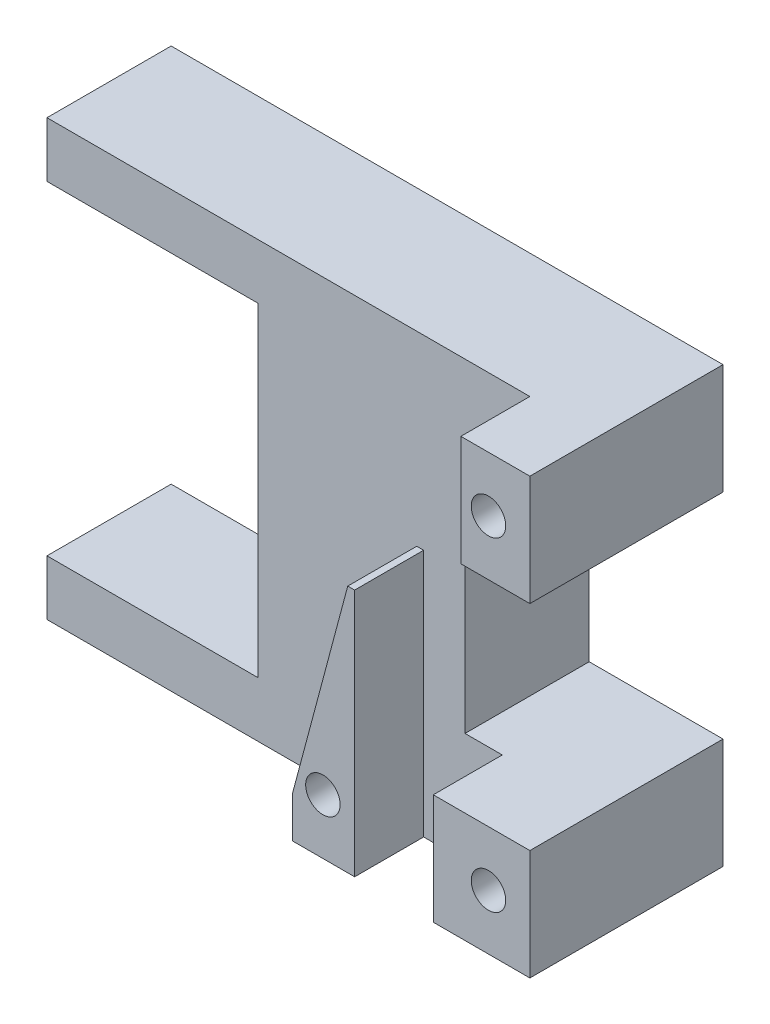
from build123d import *

# Parameters (mm, degrees)
BOSS_EXTRUDE1_DEPTH = 9
SKETCH2_W           = 7
SKETCH2_H           = 8
SKETCH2_W_2         = 5
SKETCH2_W_3         = 4.5
SKETCH2_H_2         = 18
BOSS_EXTRUDE2_DEPTH = 5
CHAMFER1_SIZE       = 4
CHAMFER1_SIZE2      = 15
SKETCH4_R           = 1.25
CUT_EXTRUDE1_DEPTH  = 5
SKETCH6_R           = 1.25
CUT_EXTRUDE2_DEPTH  = 5


with BuildPart() as part:
    # Sketch1 → Boss-Extrude1 (new body)
    with BuildSketch(Plane(origin=(0, 0, 0), x_dir=(-1, 0, 0), z_dir=(0, 0, 1))):
        Polygon((2.506726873, 26.793287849), (-37.493273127, 26.793287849), (-37.493273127, 18.793287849), (-27.793273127, 18.793287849), (-27.793273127, 3.293287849), (-37.493273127, 3.293287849), (-37.493273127, -4.706712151), (2.506726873, -4.706712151), (2.506726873, -0.706712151), (-2.508088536, -0.706712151), (-12.793273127, -0.706712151), (-12.793273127, 22.793287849), (-2.408790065, 22.793287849), (2.506726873, 22.793287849), align=None)
    extrude(amount=BOSS_EXTRUDE1_DEPTH)

    # Sketch2 → Boss-Extrude2 (add)
    with BuildSketch(Plane.XY.offset(9)):
        with Locations((33.993273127, -22.793287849)):
            Rectangle(SKETCH2_W, SKETCH2_H)
        with Locations((34.993273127, 0.706712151)):
            Rectangle(SKETCH2_W_2, SKETCH2_H)
        with Locations((22.543273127, -17.793287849)):
            Rectangle(SKETCH2_W_3, SKETCH2_H_2)
    extrude(amount=BOSS_EXTRUDE2_DEPTH)

    # Chamfer1
    chamfer1_edges = [part.edges().sort_by_distance(p)[0] for p in [
        (20.293273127, -8.793287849, 11.5),
    ]]
    chamfer1_side = [part.faces().sort_by_distance(p)[0] for p in [
        (22.543273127, -8.793287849, 11.5),
    ]]
    chamfer(chamfer1_edges, length=CHAMFER1_SIZE, length2=CHAMFER1_SIZE2, reference=chamfer1_side[0])

    # Sketch4 → Cut-Extrude1 (cut)
    with BuildSketch(Plane.XY.offset(14)):
        with Locations((34.493273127, -22.793287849)):
            Circle(SKETCH4_R)
        with Locations((34.493273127, 0.706712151)):
            Circle(SKETCH4_R)
        with Locations((22.493273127, -22.793287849)):
            Circle(SKETCH4_R)
    extrude(amount=-CUT_EXTRUDE1_DEPTH, mode=Mode.SUBTRACT)

    # Sketch6 → Cut-Extrude2 (cut)
    with BuildSketch(Plane(origin=(0, 0, 0), x_dir=(-1, 0, 0), z_dir=(0, 0, -1))):
        with Locations((-25.293273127, -1.793287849)):
            Circle(SKETCH6_R)
        with Locations((-15.293273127, -1.793287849)):
            Circle(SKETCH6_R)
        with Locations((-15.293273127, -21.793287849)):
            Circle(SKETCH6_R)
        with Locations((-25.293273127, -21.793287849)):
            Circle(SKETCH6_R)
    extrude(amount=-CUT_EXTRUDE2_DEPTH, mode=Mode.SUBTRACT)


solid = part.part
